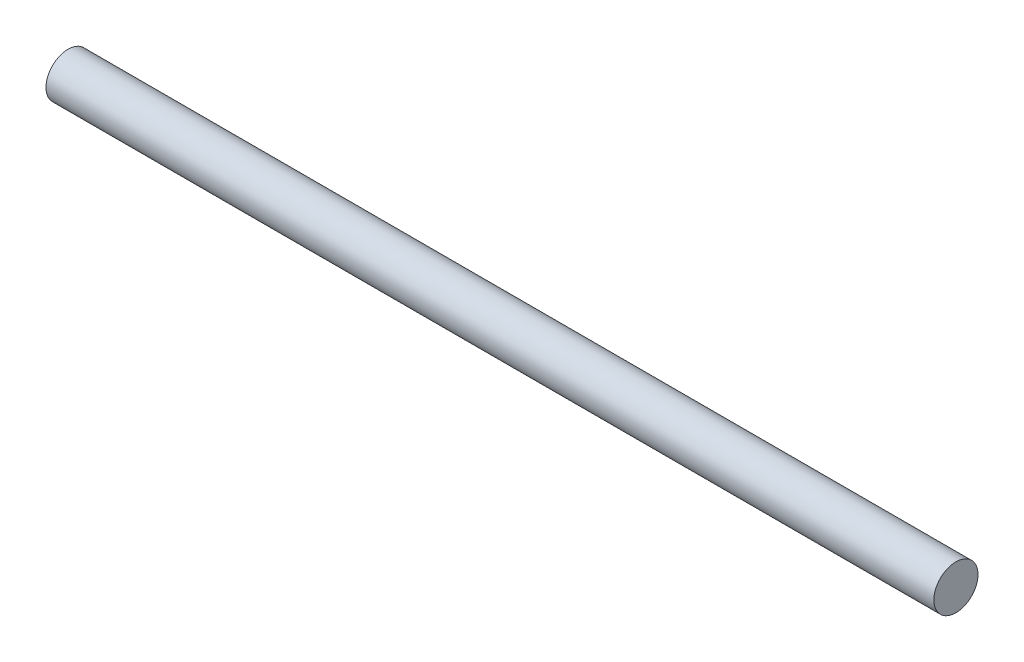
from build123d import *

# Parameters (mm, degrees)
CONG_1_R                = 2
ESQUISSE2_R             = 8
ENL_V_MAT_EXTRU_1_DEPTH = 500


with BuildPart() as part:
    # Esquisse1 → R_volution1 (revolve)
    with BuildSketch(Plane.XY):
        Polygon((0, 0), (-201, 0), (-201, 5), (0, 5), (0, 8), (-1, 8), (-1, 11.5), (34, 11.5), (34, 11), (35.5, 11), (35.5, 11.5), (237, 11.5), (237, 0), align=None)
    revolve(axis=Axis((0, 0, 0), (-1, 0, 0)))

    # Cong_1
    cong_1_edges = [part.edges().sort_by_distance(p)[0] for p in [
        (-1, -11.5, 0),
        (237, -11.5, 0),
    ]]
    fillet(cong_1_edges, radius=CONG_1_R)

    # Esquisse2 → Enl_v. mat.-Extru.1 (cut)
    with BuildSketch(Plane.ZY):
        Circle(ESQUISSE2_R)
    extrude(amount=-ENL_V_MAT_EXTRU_1_DEPTH, mode=Mode.SUBTRACT)


with BuildPart() as enl_v_mat_extru_1_kept_piece:
    # of the separate pieces the step leaves, the one the design keeps (enl_v_mat_extru_1_pieces_kept)
    add(part.part.solids().sort_by_distance((-201, 5, 0))[0])


solid = enl_v_mat_extru_1_kept_piece.part
